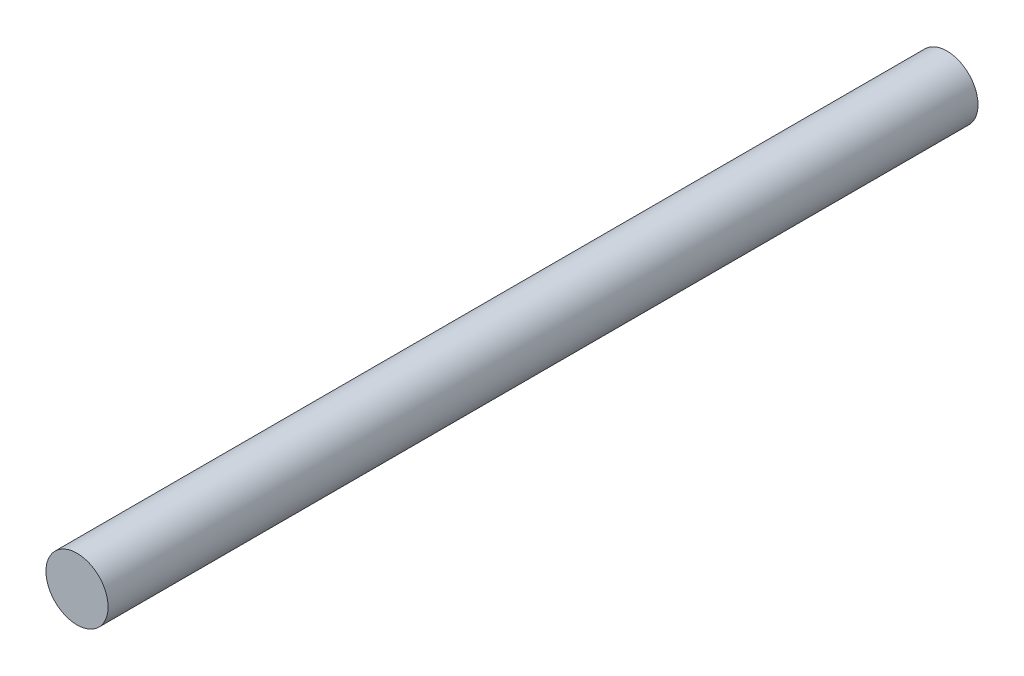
ISO-10303-21;
HEADER;
FILE_DESCRIPTION(('STEP AP214'),'2;1');
FILE_NAME('part.step','',(''),(''),'','','');
FILE_SCHEMA(('AUTOMOTIVE_DESIGN { 1 0 10303 214 1 1 1 1 }'));
ENDSEC;
DATA;
#1=APPLICATION_CONTEXT('core data for automotive mechanical design processes');
#2=APPLICATION_PROTOCOL_DEFINITION('international standard','automotive_design',2000,#1);
#3=PRODUCT_CONTEXT('',#1,'mechanical');
#4=PRODUCT('Part','Part','',(#3));
#5=PRODUCT_RELATED_PRODUCT_CATEGORY('part','',(#4));
#6=PRODUCT_DEFINITION_FORMATION('','',#4);
#7=PRODUCT_DEFINITION_CONTEXT('part definition',#1,'design');
#8=PRODUCT_DEFINITION('design','',#6,#7);
#9=PRODUCT_DEFINITION_SHAPE('','',#8);
#10=(LENGTH_UNIT() NAMED_UNIT(*) SI_UNIT(.MILLI.,.METRE.));
#11=(NAMED_UNIT(*) PLANE_ANGLE_UNIT() SI_UNIT($,.RADIAN.));
#12=(NAMED_UNIT(*) SI_UNIT($,.STERADIAN.) SOLID_ANGLE_UNIT());
#13=UNCERTAINTY_MEASURE_WITH_UNIT(LENGTH_MEASURE(1.E-05),#10,'distance_accuracy_value','');
#14=(GEOMETRIC_REPRESENTATION_CONTEXT(3) GLOBAL_UNCERTAINTY_ASSIGNED_CONTEXT((#13)) GLOBAL_UNIT_ASSIGNED_CONTEXT((#10,
#11,#12)) REPRESENTATION_CONTEXT('',''));
#15=CARTESIAN_POINT('',(0.,0.,0.));
#16=DIRECTION('',(0.,0.,1.));
#17=DIRECTION('',(1.,0.,0.));
#18=AXIS2_PLACEMENT_3D('',#15,#16,#17);
#19=CARTESIAN_POINT('',(0.,0.,80.));
#20=DIRECTION('',(0.,0.,-1.));
#21=DIRECTION('',(-1.,0.,0.));
#22=AXIS2_PLACEMENT_3D('',#19,#20,#21);
#23=CYLINDRICAL_SURFACE('',#22,5.715);
#24=CARTESIAN_POINT('',(0.,0.,80.));
#25=DIRECTION('',(0.,0.,1.));
#26=DIRECTION('',(1.,0.,0.));
#27=AXIS2_PLACEMENT_3D('',#24,#25,#26);
#28=CIRCLE('',#27,5.715);
#29=CARTESIAN_POINT('',(5.715,0.,80.));
#30=VERTEX_POINT('',#29);
#31=EDGE_CURVE('E10',#30,#30,#28,.T.);
#32=ORIENTED_EDGE('',*,*,#31,.F.);
#33=EDGE_LOOP('',(#32));
#34=FACE_BOUND('',#33,.T.);
#35=CARTESIAN_POINT('',(0.,0.,-80.));
#36=DIRECTION('',(0.,0.,1.));
#37=DIRECTION('',(1.,0.,0.));
#38=AXIS2_PLACEMENT_3D('',#35,#36,#37);
#39=CIRCLE('',#38,5.715);
#40=CARTESIAN_POINT('',(5.715,0.,-80.));
#41=VERTEX_POINT('',#40);
#42=EDGE_CURVE('E34',#41,#41,#39,.T.);
#43=ORIENTED_EDGE('',*,*,#42,.T.);
#44=EDGE_LOOP('',(#43));
#45=FACE_BOUND('',#44,.T.);
#46=ADVANCED_FACE('F31',(#34,#45),#23,.T.);
#47=CARTESIAN_POINT('',(0.,0.,80.));
#48=DIRECTION('',(0.,0.,1.));
#49=DIRECTION('',(1.,0.,0.));
#50=AXIS2_PLACEMENT_3D('',#47,#48,#49);
#51=PLANE('',#50);
#52=ORIENTED_EDGE('',*,*,#31,.T.);
#53=EDGE_LOOP('',(#52));
#54=FACE_BOUND('',#53,.T.);
#55=ADVANCED_FACE('F46',(#54),#51,.T.);
#56=CARTESIAN_POINT('',(0.,0.,-80.));
#57=DIRECTION('',(0.,0.,1.));
#58=DIRECTION('',(1.,0.,0.));
#59=AXIS2_PLACEMENT_3D('',#56,#57,#58);
#60=PLANE('',#59);
#61=ORIENTED_EDGE('',*,*,#42,.F.);
#62=EDGE_LOOP('',(#61));
#63=FACE_BOUND('',#62,.T.);
#64=ADVANCED_FACE('F44',(#63),#60,.F.);
#65=CLOSED_SHELL('',(#46,#55,#64));
#66=MANIFOLD_SOLID_BREP('B2',#65);
#67=ADVANCED_BREP_SHAPE_REPRESENTATION('',(#18,#66),#14);
#68=SHAPE_DEFINITION_REPRESENTATION(#9,#67);
ENDSEC;
END-ISO-10303-21;
